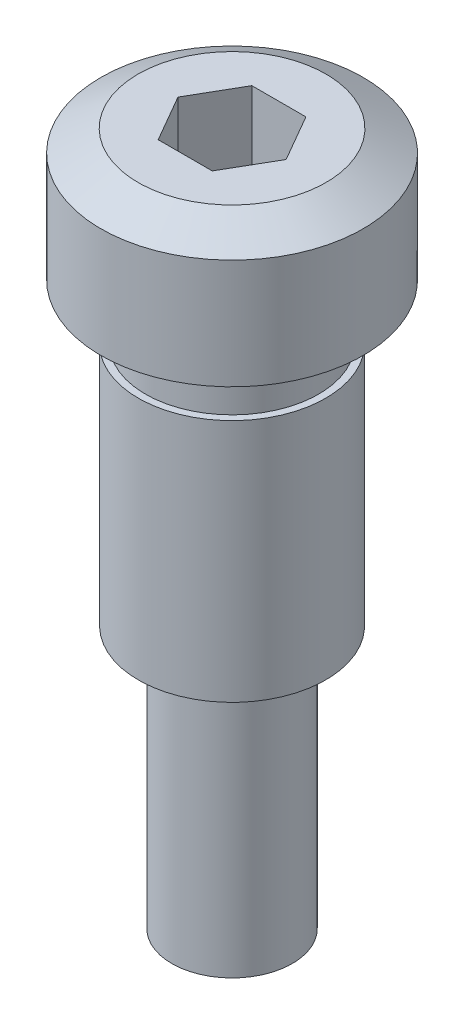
from build123d import *

# Parameters (mm, degrees)
SOCKET_CUT_EXTRUDE_DEPTH = 2.9718


with BuildPart() as part:
    # Profile Sketch → Shoulder Imp Base-Revolve (revolve)
    with BuildSketch(Plane.XY, mode=Mode.PRIVATE) as shoulder_imp_base_revolve_sk:
        Polygon((0, 5.55752), (3.98126156, 5.55752), (5.55625, 4.6482), (5.55625, 0), (3.6703, 0), (3.6703, -2.3622), (3.96875, -2.3622), (3.96875, -12.7), (2.5527, -12.7), (2.5527, -23.8125), (0, -23.8125), align=None)
    revolve(shoulder_imp_base_revolve_sk.sketch.rotate(Axis((0, 5.55752, 0), (0, -1, 0)), 180), axis=Axis((0, 5.55752, 0), (0, -1, 0)))

    # Hex Sketch → Socket Cut-Extrude (cut)
    with BuildSketch(Plane(origin=(0, 5.55752, 0), x_dir=(-1, 0, 0), z_dir=(0, 1, 0))):
        Polygon((-2.290625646, 0), (-1.145312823, -1.98374), (1.145312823, -1.98374), (2.290625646, 0), (1.145312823, 1.98374), (-1.145312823, 1.98374), align=None)
    extrude(amount=-SOCKET_CUT_EXTRUDE_DEPTH, mode=Mode.SUBTRACT)


solid = part.part
